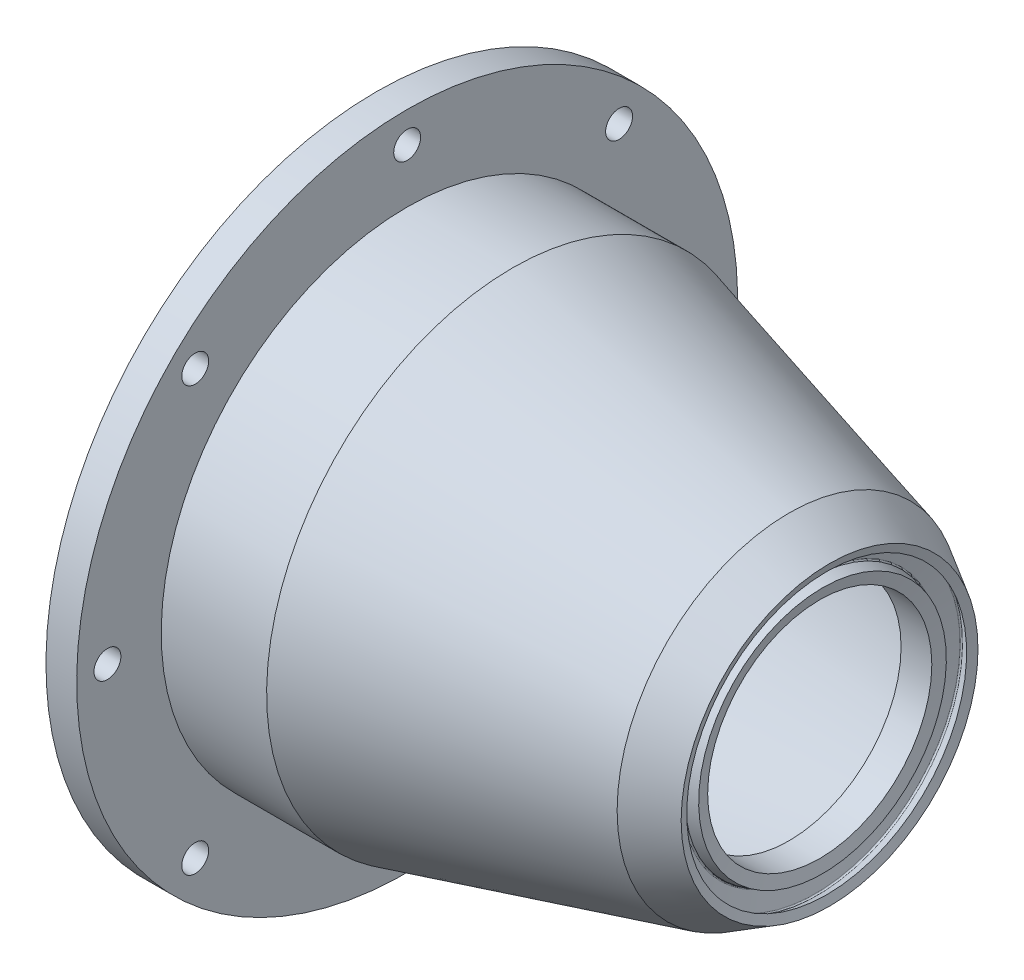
from build123d import *

# Parameters (mm, degrees)
F_7_32_0_21875_DIAMETER_HOLE1_D = 5.55625


with BuildPart() as part:
    # Sketch1 → Revolve3 (revolve)
    with BuildSketch(Plane.XY):
        with BuildLine():
            Line((-190.5, 68.2625), (-184.15, 68.2625))
            Line((-184.15, 68.2625), (-184.15, 50.8))
            Line((-184.15, 50.8), (-162.381972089, 50.8))
            Line((-162.381972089, 50.8), (-105.280059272, 35.499588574))
            Line((-105.280059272, 35.499588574), (-96.896244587, 30.65919091))
            Line((-96.896244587, 30.65919091), (-97.497287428, 28.911071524))
            Line((-97.497287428, 28.911071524), (-99.48389692, 30.058041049))
            ThreePointArc((-99.48389692, 30.058041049), (-99.708098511, 30.072735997), (-99.856242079, 29.903810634))
            Line((-99.856242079, 29.903810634), (-100.769816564, 26.494304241))
            ThreePointArc((-100.769816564, 26.494304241), (-100.744441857, 26.301564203), (-100.590211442, 26.183219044))
            Line((-100.590211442, 26.183219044), (-98.357570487, 25.584984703))
            Line((-98.357570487, 25.584984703), (-98.926944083, 23.1521))
            Line((-98.926944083, 23.1521), (-105.276944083, 23.1521))
            Line((-105.276944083, 23.1521), (-105.276944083, 32.211751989))
            Line((-105.276944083, 32.211751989), (-162.799968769, 47.625))
            Line((-162.799968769, 47.625), (-192.8876, 47.625))
            Line((-192.8876, 47.625), (-192.8876, 50.927))
            Line((-192.8876, 50.927), (-190.5, 50.927))
            Line((-190.5, 50.927), (-190.5, 52.1843))
            Line((-190.5, 52.1843), (-188.1886, 52.1843))
            ThreePointArc((-188.1886, 52.1843), (-188.008994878, 52.258694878), (-187.9346, 52.4383))
            Line((-187.9346, 52.4383), (-187.9346, 55.968080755))
            ThreePointArc((-187.9346, 55.968080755), (-188.033974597, 56.169592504), (-188.254340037, 56.213425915))
            Line((-188.254340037, 56.213425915), (-190.5, 55.611703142))
            Line((-190.5, 55.611703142), (-190.5, 68.2625))
        make_face()
    revolve(axis=Axis((0, 0, 0), (-1, 0, 0)))

    # 7_32 _0.21875_ Diameter Hole1 (through all)
    with Locations(Plane.ZY.offset(190.5)):
        with Locations((61.9125, 0), (43.77874859, 43.77874859), (0, 61.9125), (43.77874859, -43.77874859), (0, -61.9125), (-43.77874859, 43.77874859), (-61.9125, 0), (-43.77874859, -43.77874859)):
            Hole(F_7_32_0_21875_DIAMETER_HOLE1_D / 2)


solid = part.part
